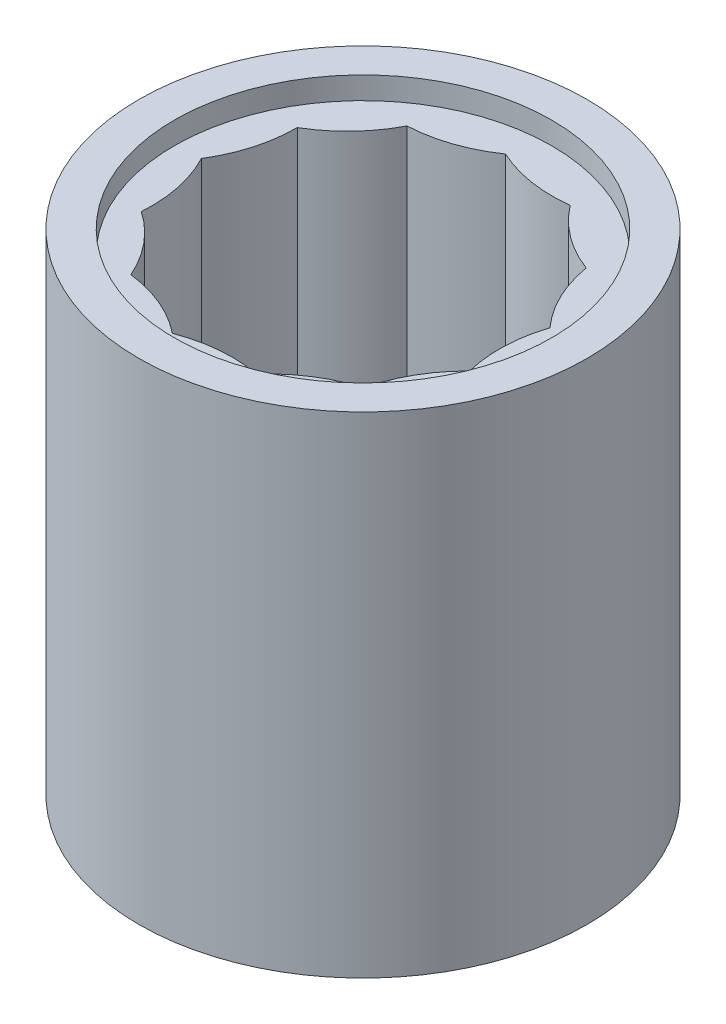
ISO-10303-21;
HEADER;
FILE_DESCRIPTION(('STEP AP214'),'2;1');
FILE_NAME('part.step','',(''),(''),'','','');
FILE_SCHEMA(('AUTOMOTIVE_DESIGN { 1 0 10303 214 1 1 1 1 }'));
ENDSEC;
DATA;
#1=APPLICATION_CONTEXT('core data for automotive mechanical design processes');
#2=APPLICATION_PROTOCOL_DEFINITION('international standard','automotive_design',2000,#1);
#3=PRODUCT_CONTEXT('',#1,'mechanical');
#4=PRODUCT('Part','Part','',(#3));
#5=PRODUCT_RELATED_PRODUCT_CATEGORY('part','',(#4));
#6=PRODUCT_DEFINITION_FORMATION('','',#4);
#7=PRODUCT_DEFINITION_CONTEXT('part definition',#1,'design');
#8=PRODUCT_DEFINITION('design','',#6,#7);
#9=PRODUCT_DEFINITION_SHAPE('','',#8);
#10=(LENGTH_UNIT() NAMED_UNIT(*) SI_UNIT(.MILLI.,.METRE.));
#11=(NAMED_UNIT(*) PLANE_ANGLE_UNIT() SI_UNIT($,.RADIAN.));
#12=(NAMED_UNIT(*) SI_UNIT($,.STERADIAN.) SOLID_ANGLE_UNIT());
#13=UNCERTAINTY_MEASURE_WITH_UNIT(LENGTH_MEASURE(1.E-05),#10,'distance_accuracy_value','');
#14=(GEOMETRIC_REPRESENTATION_CONTEXT(3) GLOBAL_UNCERTAINTY_ASSIGNED_CONTEXT((#13)) GLOBAL_UNIT_ASSIGNED_CONTEXT((#10,
#11,#12)) REPRESENTATION_CONTEXT('',''));
#15=CARTESIAN_POINT('',(0.,0.,0.));
#16=DIRECTION('',(0.,0.,1.));
#17=DIRECTION('',(1.,0.,0.));
#18=AXIS2_PLACEMENT_3D('',#15,#16,#17);
#19=CARTESIAN_POINT('',(-26.1566046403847,89.4000000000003,12.7706739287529));
#20=DIRECTION('',(0.,-1.,0.));
#21=DIRECTION('',(0.,0.,-0.999999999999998));
#22=AXIS2_PLACEMENT_3D('',#19,#20,#21);
#23=CYLINDRICAL_SURFACE('',#22,45.7150292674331);
#24=CARTESIAN_POINT('',(-26.1566046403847,89.4000000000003,12.7706739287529));
#25=DIRECTION('',(0.,-1.,0.));
#26=DIRECTION('',(0.,0.,-0.999999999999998));
#27=AXIS2_PLACEMENT_3D('',#24,#25,#26);
#28=CIRCLE('',#27,45.7150292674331);
#29=CARTESIAN_POINT('',(-26.1566046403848,89.4000000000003,-32.9443553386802));
#30=VERTEX_POINT('',#29);
#31=EDGE_CURVE('E310',#30,#30,#28,.T.);
#32=ORIENTED_EDGE('',*,*,#31,.F.);
#33=EDGE_LOOP('',(#32));
#34=FACE_BOUND('',#33,.T.);
#35=CARTESIAN_POINT('',(-26.1566046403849,84.0000000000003,12.7706739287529));
#36=DIRECTION('',(0.,-1.,0.));
#37=DIRECTION('',(0.,0.,-0.999999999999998));
#38=AXIS2_PLACEMENT_3D('',#35,#36,#37);
#39=CIRCLE('',#38,45.7150292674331);
#40=CARTESIAN_POINT('',(-26.1566046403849,84.0000000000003,-32.9443553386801));
#41=VERTEX_POINT('',#40);
#42=EDGE_CURVE('E11',#41,#41,#39,.T.);
#43=ORIENTED_EDGE('',*,*,#42,.T.);
#44=EDGE_LOOP('',(#43));
#45=FACE_BOUND('',#44,.T.);
#46=ADVANCED_FACE('F34',(#34,#45),#23,.F.);
#47=CARTESIAN_POINT('',(-26.1566046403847,89.4000000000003,12.7706739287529));
#48=DIRECTION('',(0.,-1.,0.));
#49=DIRECTION('',(0.,0.,-0.999999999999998));
#50=AXIS2_PLACEMENT_3D('',#47,#48,#49);
#51=CYLINDRICAL_SURFACE('',#50,54.3254175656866);
#52=CARTESIAN_POINT('',(-26.1566046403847,89.4000000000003,12.7706739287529));
#53=DIRECTION('',(0.,-1.,0.));
#54=DIRECTION('',(0.,0.,-0.999999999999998));
#55=AXIS2_PLACEMENT_3D('',#52,#53,#54);
#56=CIRCLE('',#55,54.3254175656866);
#57=CARTESIAN_POINT('',(-26.1566046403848,89.4000000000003,-41.5547436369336));
#58=VERTEX_POINT('',#57);
#59=EDGE_CURVE('E316',#58,#58,#56,.T.);
#60=ORIENTED_EDGE('',*,*,#59,.T.);
#61=EDGE_LOOP('',(#60));
#62=FACE_BOUND('',#61,.T.);
#63=CARTESIAN_POINT('',(-26.1566046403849,-29.3999999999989,12.7706739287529));
#64=DIRECTION('',(0.,-1.,0.));
#65=DIRECTION('',(0.,0.,-0.999999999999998));
#66=AXIS2_PLACEMENT_3D('',#63,#64,#65);
#67=CIRCLE('',#66,54.3254175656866);
#68=CARTESIAN_POINT('',(-26.1566046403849,-29.3999999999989,-41.5547436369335));
#69=VERTEX_POINT('',#68);
#70=EDGE_CURVE('E313',#69,#69,#67,.T.);
#71=ORIENTED_EDGE('',*,*,#70,.F.);
#72=EDGE_LOOP('',(#71));
#73=FACE_BOUND('',#72,.T.);
#74=ADVANCED_FACE('F285',(#62,#73),#51,.T.);
#75=CARTESIAN_POINT('',(-26.1566046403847,89.4000000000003,12.7706739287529));
#76=DIRECTION('',(0.,-1.,0.));
#77=DIRECTION('',(0.,0.,-0.999999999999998));
#78=AXIS2_PLACEMENT_3D('',#75,#76,#77);
#79=PLANE('',#78);
#80=ORIENTED_EDGE('',*,*,#31,.T.);
#81=EDGE_LOOP('',(#80));
#82=FACE_BOUND('',#81,.T.);
#83=ORIENTED_EDGE('',*,*,#59,.F.);
#84=EDGE_LOOP('',(#83));
#85=FACE_BOUND('',#84,.T.);
#86=ADVANCED_FACE('F291',(#82,#85),#79,.F.);
#87=CARTESIAN_POINT('',(-26.1566046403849,-29.3999999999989,12.7706739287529));
#88=DIRECTION('',(0.,-1.,0.));
#89=DIRECTION('',(0.,0.,-0.999999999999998));
#90=AXIS2_PLACEMENT_3D('',#87,#88,#89);
#91=PLANE('',#90);
#92=CARTESIAN_POINT('',(-26.1566046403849,-29.3999999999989,12.7706739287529));
#93=DIRECTION('',(0.,-1.,0.));
#94=DIRECTION('',(0.,0.,-0.999999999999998));
#95=AXIS2_PLACEMENT_3D('',#92,#93,#94);
#96=CIRCLE('',#95,45.7150292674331);
#97=CARTESIAN_POINT('',(-26.1566046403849,-29.3999999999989,-32.9443553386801));
#98=VERTEX_POINT('',#97);
#99=EDGE_CURVE('E309',#98,#98,#96,.T.);
#100=ORIENTED_EDGE('',*,*,#99,.F.);
#101=EDGE_LOOP('',(#100));
#102=FACE_BOUND('',#101,.T.);
#103=ORIENTED_EDGE('',*,*,#70,.T.);
#104=EDGE_LOOP('',(#103));
#105=FACE_BOUND('',#104,.T.);
#106=ADVANCED_FACE('F297',(#102,#105),#91,.T.);
#107=CARTESIAN_POINT('',(-26.1566046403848,-23.999999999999,12.7706739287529));
#108=DIRECTION('',(0.,-1.,0.));
#109=DIRECTION('',(0.,0.,-0.999999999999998));
#110=AXIS2_PLACEMENT_3D('',#107,#108,#109);
#111=CIRCLE('',#110,45.7150292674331);
#112=CARTESIAN_POINT('',(-26.1566046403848,-23.999999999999,-32.9443553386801));
#113=VERTEX_POINT('',#112);
#114=EDGE_CURVE('E38',#113,#113,#111,.T.);
#115=ORIENTED_EDGE('',*,*,#114,.F.);
#116=EDGE_LOOP('',(#115));
#117=FACE_BOUND('',#116,.T.);
#118=ORIENTED_EDGE('',*,*,#99,.T.);
#119=EDGE_LOOP('',(#118));
#120=FACE_BOUND('',#119,.T.);
#121=ADVANCED_FACE('F280',(#117,#120),#23,.F.);
#122=CARTESIAN_POINT('',(15.6258180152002,84.0000000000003,-43.3377819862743));
#123=DIRECTION('',(0.,-1.,0.));
#124=DIRECTION('',(0.,0.,-0.999999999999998));
#125=AXIS2_PLACEMENT_3D('',#122,#123,#124);
#126=PLANE('',#125);
#127=CARTESIAN_POINT('',(15.6258180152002,84.0000000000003,-43.3377819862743));
#128=DIRECTION('',(0.,1.,0.));
#129=DIRECTION('',(0.,0.,-0.999999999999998));
#130=AXIS2_PLACEMENT_3D('',#127,#128,#129);
#131=CIRCLE('',#130,34.023963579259);
#132=CARTESIAN_POINT('',(-11.4270866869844,84.0000000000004,-22.7035762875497));
#133=VERTEX_POINT('',#132);
#134=CARTESIAN_POINT('',(3.6743239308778,84.,-11.4819836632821));
#135=VERTEX_POINT('',#134);
#136=EDGE_CURVE('E43',#133,#135,#131,.T.);
#137=ORIENTED_EDGE('',*,*,#136,.T.);
#138=CARTESIAN_POINT('',(37.2176749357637,84.,-17.1805537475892));
#139=DIRECTION('',(0.,1.,0.));
#140=DIRECTION('',(0.464723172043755,0.,-0.885456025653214));
#141=AXIS2_PLACEMENT_3D('',#138,#139,#140);
#142=CIRCLE('',#141,34.023963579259);
#143=CARTESIAN_POINT('',(11.8310248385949,83.9999999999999,5.47221858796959));
#144=VERTEX_POINT('',#143);
#145=EDGE_CURVE('E136',#135,#144,#142,.T.);
#146=ORIENTED_EDGE('',*,*,#145,.T.);
#147=CARTESIAN_POINT('',(44.1804446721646,84.0000000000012,16.0147578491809));
#148=DIRECTION('',(0.,1.,0.));
#149=DIRECTION('',(0.822983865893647,0.,-0.568064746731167));
#150=AXIS2_PLACEMENT_3D('',#147,#148,#149);
#151=CIRCLE('',#150,34.023963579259);
#152=CARTESIAN_POINT('',(11.1744141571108,84.,24.2750270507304));
#153=VERTEX_POINT('',#152);
#154=EDGE_CURVE('E147',#144,#153,#151,.T.);
#155=ORIENTED_EDGE('',*,*,#154,.T.);
#156=CARTESIAN_POINT('',(34.9190405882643,84.0000000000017,48.6435069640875));
#157=DIRECTION('',(0.,1.,0.));
#158=DIRECTION('',(0.99270887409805,0.,-0.120536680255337));
#159=AXIS2_PLACEMENT_3D('',#156,#157,#158);
#160=CIRCLE('',#159,34.023963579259);
#161=CARTESIAN_POINT('',(1.85491348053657,84.,40.6189449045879));
#162=VERTEX_POINT('',#161);
#163=EDGE_CURVE('E158',#153,#162,#160,.T.);
#164=ORIENTED_EDGE('',*,*,#163,.T.);
#165=CARTESIAN_POINT('',(11.5551387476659,84.0000000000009,73.2308403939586));
#166=DIRECTION('',(0.,1.,0.));
#167=DIRECTION('',(0.935016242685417,0.,0.354604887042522));
#168=AXIS2_PLACEMENT_3D('',#165,#166,#167);
#169=CIRCLE('',#168,34.023963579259);
#170=CARTESIAN_POINT('',(-13.9924918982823,84.,50.7597775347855));
#171=VERTEX_POINT('',#170);
#172=EDGE_CURVE('E166',#162,#171,#169,.T.);
#173=ORIENTED_EDGE('',*,*,#172,.T.);
#174=CARTESIAN_POINT('',(-20.5588725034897,84.0000000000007,84.1440963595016));
#175=DIRECTION('',(0.,1.,0.));
#176=DIRECTION('',(0.663122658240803,0.,0.748510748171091));
#177=AXIS2_PLACEMENT_3D('',#174,#175,#176);
#178=CIRCLE('',#177,34.023963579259);
#179=CARTESIAN_POINT('',(-32.7373523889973,84.,52.3743823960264));
#180=VERTEX_POINT('',#179);
#181=EDGE_CURVE('E175',#171,#180,#178,.T.);
#182=ORIENTED_EDGE('',*,*,#181,.T.);
#183=CARTESIAN_POINT('',(-54.0660602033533,84.,78.8831794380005));
#184=DIRECTION('',(0.,1.,0.));
#185=DIRECTION('',(0.239315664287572,0.,0.970941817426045));
#186=AXIS2_PLACEMENT_3D('',#183,#184,#185);
#187=CIRCLE('',#186,34.023963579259);
#188=CARTESIAN_POINT('',(-50.0854463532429,84.,45.0928729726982));
#189=VERTEX_POINT('',#188);
#190=EDGE_CURVE('E184',#180,#189,#187,.T.);
#191=ORIENTED_EDGE('',*,*,#190,.T.);
#192=CARTESIAN_POINT('',(-81.2903314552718,84.,58.6533022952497));
#193=DIRECTION('',(0.,1.,0.));
#194=DIRECTION('',(-0.239315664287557,0.,0.970941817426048));
#195=AXIS2_PLACEMENT_3D('',#192,#193,#194);
#196=CIRCLE('',#195,34.023963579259);
#197=CARTESIAN_POINT('',(-62.0625345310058,83.9999999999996,30.5833553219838));
#198=VERTEX_POINT('',#197);
#199=EDGE_CURVE('E193',#189,#198,#196,.T.);
#200=ORIENTED_EDGE('',*,*,#199,.T.);
#201=CARTESIAN_POINT('',(-95.9949338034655,84.,28.0888859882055));
#202=DIRECTION('',(0.,1.,0.));
#203=DIRECTION('',(-0.663122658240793,0.,0.748510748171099));
#204=AXIS2_PLACEMENT_3D('',#201,#202,#203);
#205=CIRCLE('',#204,34.023963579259);
#206=CARTESIAN_POINT('',(-65.9248103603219,84.,12.1697850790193));
#207=VERTEX_POINT('',#206);
#208=EDGE_CURVE('E202',#198,#207,#205,.T.);
#209=ORIENTED_EDGE('',*,*,#208,.T.);
#210=CARTESIAN_POINT('',(-94.811220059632,84.,-5.80813004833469));
#211=DIRECTION('',(0.,1.,0.));
#212=DIRECTION('',(-0.935016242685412,0.,0.354604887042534));
#213=AXIS2_PLACEMENT_3D('',#210,#211,#212);
#214=CIRCLE('',#213,34.023963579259);
#215=CARTESIAN_POINT('',(-60.7874729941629,84.0000000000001,-5.92951072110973));
#216=VERTEX_POINT('',#215);
#217=EDGE_CURVE('E211',#207,#216,#214,.T.);
#218=ORIENTED_EDGE('',*,*,#217,.T.);
#219=CARTESIAN_POINT('',(-78.0103647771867,84.,-35.2723479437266));
#220=DIRECTION('',(0.,1.,0.));
#221=DIRECTION('',(-0.992708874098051,0.,-0.120536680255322));
#222=AXIS2_PLACEMENT_3D('',#219,#220,#221);
#223=CIRCLE('',#222,34.023963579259);
#224=CARTESIAN_POINT('',(-47.8274245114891,84.0000000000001,-19.5682015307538));
#225=VERTEX_POINT('',#224);
#226=EDGE_CURVE('E220',#216,#225,#223,.T.);
#227=ORIENTED_EDGE('',*,*,#226,.T.);
#228=CARTESIAN_POINT('',(-49.4412414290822,84.0000000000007,-53.5538704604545));
#229=DIRECTION('',(0.,1.,0.));
#230=DIRECTION('',(-0.822983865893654,0.,-0.568064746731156));
#231=AXIS2_PLACEMENT_3D('',#228,#229,#230);
#232=CIRCLE('',#231,34.023963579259);
#233=CARTESIAN_POINT('',(-30.0136558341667,84.,-25.6218276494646));
#234=VERTEX_POINT('',#233);
#235=EDGE_CURVE('E229',#225,#234,#232,.T.);
#236=ORIENTED_EDGE('',*,*,#235,.T.);
#237=CARTESIAN_POINT('',(-15.6486918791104,84.0000000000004,-56.464621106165));
#238=DIRECTION('',(0.,1.,0.));
#239=DIRECTION('',(-0.464723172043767,0.,-0.885456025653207));
#240=AXIS2_PLACEMENT_3D('',#237,#238,#239);
#241=CIRCLE('',#240,34.023963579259);
#242=EDGE_CURVE('E238',#234,#133,#241,.T.);
#243=ORIENTED_EDGE('',*,*,#242,.T.);
#244=EDGE_LOOP('',(#137,#146,#155,#164,#173,#182,#191,#200,#209,#218,#227,#236,#243));
#245=FACE_BOUND('',#244,.T.);
#246=ORIENTED_EDGE('',*,*,#42,.F.);
#247=EDGE_LOOP('',(#246));
#248=FACE_BOUND('',#247,.T.);
#249=ADVANCED_FACE('F277',(#245,#248),#126,.F.);
#250=CARTESIAN_POINT('',(15.6258180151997,-23.9999999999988,-43.3377819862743));
#251=DIRECTION('',(0.,-1.,0.));
#252=DIRECTION('',(0.,0.,-0.999999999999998));
#253=AXIS2_PLACEMENT_3D('',#250,#251,#252);
#254=PLANE('',#253);
#255=CARTESIAN_POINT('',(37.2176749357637,-24.,-17.1805537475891));
#256=DIRECTION('',(0.,1.,0.));
#257=DIRECTION('',(0.464723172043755,0.,-0.885456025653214));
#258=AXIS2_PLACEMENT_3D('',#255,#256,#257);
#259=CIRCLE('',#258,34.023963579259);
#260=CARTESIAN_POINT('',(3.67432393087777,-24.,-11.481983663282));
#261=VERTEX_POINT('',#260);
#262=CARTESIAN_POINT('',(11.8310248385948,-24.,5.47221858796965));
#263=VERTEX_POINT('',#262);
#264=EDGE_CURVE('E129',#261,#263,#259,.T.);
#265=ORIENTED_EDGE('',*,*,#264,.F.);
#266=CARTESIAN_POINT('',(15.6258180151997,-23.9999999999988,-43.3377819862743));
#267=DIRECTION('',(0.,1.,0.));
#268=DIRECTION('',(0.,0.,-0.999999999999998));
#269=AXIS2_PLACEMENT_3D('',#266,#267,#268);
#270=CIRCLE('',#269,34.023963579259);
#271=CARTESIAN_POINT('',(-11.4270866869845,-24.,-22.7035762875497));
#272=VERTEX_POINT('',#271);
#273=EDGE_CURVE('E246',#272,#261,#270,.T.);
#274=ORIENTED_EDGE('',*,*,#273,.F.);
#275=CARTESIAN_POINT('',(-15.6486918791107,-24.,-56.464621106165));
#276=DIRECTION('',(0.,1.,0.));
#277=DIRECTION('',(-0.464723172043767,0.,-0.885456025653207));
#278=AXIS2_PLACEMENT_3D('',#275,#276,#277);
#279=CIRCLE('',#278,34.023963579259);
#280=CARTESIAN_POINT('',(-30.0136558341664,-23.9999999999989,-25.6218276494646));
#281=VERTEX_POINT('',#280);
#282=EDGE_CURVE('E237',#281,#272,#279,.T.);
#283=ORIENTED_EDGE('',*,*,#282,.F.);
#284=CARTESIAN_POINT('',(-49.4412414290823,-23.999999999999,-53.5538704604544));
#285=DIRECTION('',(0.,1.,0.));
#286=DIRECTION('',(-0.822983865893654,0.,-0.568064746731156));
#287=AXIS2_PLACEMENT_3D('',#284,#285,#286);
#288=CIRCLE('',#287,34.023963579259);
#289=CARTESIAN_POINT('',(-47.8274245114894,-24.,-19.5682015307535));
#290=VERTEX_POINT('',#289);
#291=EDGE_CURVE('E228',#290,#281,#288,.T.);
#292=ORIENTED_EDGE('',*,*,#291,.F.);
#293=CARTESIAN_POINT('',(-78.0103647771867,-24.,-35.2723479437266));
#294=DIRECTION('',(0.,1.,0.));
#295=DIRECTION('',(-0.992708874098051,0.,-0.120536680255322));
#296=AXIS2_PLACEMENT_3D('',#293,#294,#295);
#297=CIRCLE('',#296,34.023963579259);
#298=CARTESIAN_POINT('',(-60.7874729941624,-23.9999999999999,-5.92951072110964));
#299=VERTEX_POINT('',#298);
#300=EDGE_CURVE('E219',#299,#290,#297,.T.);
#301=ORIENTED_EDGE('',*,*,#300,.F.);
#302=CARTESIAN_POINT('',(-94.8112200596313,-23.9999999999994,-5.80813004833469));
#303=DIRECTION('',(0.,1.,0.));
#304=DIRECTION('',(-0.935016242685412,0.,0.354604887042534));
#305=AXIS2_PLACEMENT_3D('',#302,#303,#304);
#306=CIRCLE('',#305,34.023963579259);
#307=CARTESIAN_POINT('',(-65.9248103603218,-24.,12.1697850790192));
#308=VERTEX_POINT('',#307);
#309=EDGE_CURVE('E210',#308,#299,#306,.T.);
#310=ORIENTED_EDGE('',*,*,#309,.F.);
#311=CARTESIAN_POINT('',(-95.9949338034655,-24.,28.0888859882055));
#312=DIRECTION('',(0.,1.,0.));
#313=DIRECTION('',(-0.663122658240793,0.,0.748510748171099));
#314=AXIS2_PLACEMENT_3D('',#311,#312,#313);
#315=CIRCLE('',#314,34.023963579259);
#316=CARTESIAN_POINT('',(-62.0625345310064,-24.,30.5833553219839));
#317=VERTEX_POINT('',#316);
#318=EDGE_CURVE('E201',#317,#308,#315,.T.);
#319=ORIENTED_EDGE('',*,*,#318,.F.);
#320=CARTESIAN_POINT('',(-81.2903314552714,-23.9999999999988,58.6533022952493));
#321=DIRECTION('',(0.,1.,0.));
#322=DIRECTION('',(-0.239315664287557,0.,0.970941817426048));
#323=AXIS2_PLACEMENT_3D('',#320,#321,#322);
#324=CIRCLE('',#323,34.023963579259);
#325=CARTESIAN_POINT('',(-50.0854463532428,-24.0000000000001,45.0928729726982));
#326=VERTEX_POINT('',#325);
#327=EDGE_CURVE('E192',#326,#317,#324,.T.);
#328=ORIENTED_EDGE('',*,*,#327,.F.);
#329=CARTESIAN_POINT('',(-54.0660602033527,-23.9999999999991,78.8831794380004));
#330=DIRECTION('',(0.,1.,0.));
#331=DIRECTION('',(0.239315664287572,0.,0.970941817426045));
#332=AXIS2_PLACEMENT_3D('',#329,#330,#331);
#333=CIRCLE('',#332,34.023963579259);
#334=CARTESIAN_POINT('',(-32.7373523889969,-23.9999999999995,52.3743823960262));
#335=VERTEX_POINT('',#334);
#336=EDGE_CURVE('E183',#335,#326,#333,.T.);
#337=ORIENTED_EDGE('',*,*,#336,.F.);
#338=CARTESIAN_POINT('',(-20.55887250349,-23.9999999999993,84.1440963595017));
#339=DIRECTION('',(0.,1.,0.));
#340=DIRECTION('',(0.663122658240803,0.,0.748510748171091));
#341=AXIS2_PLACEMENT_3D('',#338,#339,#340);
#342=CIRCLE('',#341,34.023963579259);
#343=CARTESIAN_POINT('',(-13.9924918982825,-24.,50.7597775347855));
#344=VERTEX_POINT('',#343);
#345=EDGE_CURVE('E174',#344,#335,#342,.T.);
#346=ORIENTED_EDGE('',*,*,#345,.F.);
#347=CARTESIAN_POINT('',(11.5551387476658,-23.9999999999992,73.230840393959));
#348=DIRECTION('',(0.,1.,0.));
#349=DIRECTION('',(0.935016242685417,0.,0.354604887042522));
#350=AXIS2_PLACEMENT_3D('',#347,#348,#349);
#351=CIRCLE('',#350,34.023963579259);
#352=CARTESIAN_POINT('',(1.85491348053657,-24.,40.6189449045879));
#353=VERTEX_POINT('',#352);
#354=EDGE_CURVE('E165',#353,#344,#351,.T.);
#355=ORIENTED_EDGE('',*,*,#354,.F.);
#356=CARTESIAN_POINT('',(34.9190405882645,-24.,48.6435069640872));
#357=DIRECTION('',(0.,1.,0.));
#358=DIRECTION('',(0.99270887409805,0.,-0.120536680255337));
#359=AXIS2_PLACEMENT_3D('',#356,#357,#358);
#360=CIRCLE('',#359,34.023963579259);
#361=CARTESIAN_POINT('',(11.1744141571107,-23.9999999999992,24.2750270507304));
#362=VERTEX_POINT('',#361);
#363=EDGE_CURVE('E143',#362,#353,#360,.T.);
#364=ORIENTED_EDGE('',*,*,#363,.F.);
#365=CARTESIAN_POINT('',(44.1804446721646,-23.9999999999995,16.0147578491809));
#366=DIRECTION('',(0.,1.,0.));
#367=DIRECTION('',(0.822983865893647,0.,-0.568064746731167));
#368=AXIS2_PLACEMENT_3D('',#365,#366,#367);
#369=CIRCLE('',#368,34.023963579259);
#370=EDGE_CURVE('E139',#263,#362,#369,.T.);
#371=ORIENTED_EDGE('',*,*,#370,.F.);
#372=EDGE_LOOP('',(#265,#274,#283,#292,#301,#310,#319,#328,#337,#346,#355,#364,#371));
#373=FACE_BOUND('',#372,.T.);
#374=ORIENTED_EDGE('',*,*,#114,.T.);
#375=EDGE_LOOP('',(#374));
#376=FACE_BOUND('',#375,.T.);
#377=ADVANCED_FACE('F140',(#373,#376),#254,.T.);
#378=CARTESIAN_POINT('',(15.6258180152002,84.0000000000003,-43.3377819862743));
#379=DIRECTION('',(0.,-1.,0.));
#380=DIRECTION('',(0.,0.,-0.999999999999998));
#381=AXIS2_PLACEMENT_3D('',#378,#379,#380);
#382=CYLINDRICAL_SURFACE('',#381,34.023963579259);
#383=DIRECTION('',(0.,-1.,0.));
#384=VECTOR('',#383,1.);
#385=CARTESIAN_POINT('',(-11.4270866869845,30.,-22.7035762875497));
#386=LINE('',#385,#384);
#387=EDGE_CURVE('E244',#272,#133,#386,.F.);
#388=ORIENTED_EDGE('',*,*,#387,.F.);
#389=ORIENTED_EDGE('',*,*,#273,.T.);
#390=DIRECTION('',(0.,-1.,0.));
#391=VECTOR('',#390,1.);
#392=CARTESIAN_POINT('',(3.67432393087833,29.9999999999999,-11.481983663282));
#393=LINE('',#392,#391);
#394=EDGE_CURVE('E51',#135,#261,#393,.T.);
#395=ORIENTED_EDGE('',*,*,#394,.F.);
#396=ORIENTED_EDGE('',*,*,#136,.F.);
#397=EDGE_LOOP('',(#388,#389,#395,#396));
#398=FACE_BOUND('',#397,.T.);
#399=ADVANCED_FACE('F36',(#398),#382,.T.);
#400=CARTESIAN_POINT('',(-15.6486918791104,84.0000000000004,-56.464621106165));
#401=DIRECTION('',(0.,-1.,0.));
#402=DIRECTION('',(0.,0.,-0.999999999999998));
#403=AXIS2_PLACEMENT_3D('',#400,#401,#402);
#404=CYLINDRICAL_SURFACE('',#403,34.023963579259);
#405=ORIENTED_EDGE('',*,*,#282,.T.);
#406=ORIENTED_EDGE('',*,*,#387,.T.);
#407=ORIENTED_EDGE('',*,*,#242,.F.);
#408=DIRECTION('',(0.,-1.,0.));
#409=VECTOR('',#408,1.);
#410=CARTESIAN_POINT('',(-30.0136558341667,30.0000000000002,-25.6218276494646));
#411=LINE('',#410,#409);
#412=EDGE_CURVE('E232',#281,#234,#411,.F.);
#413=ORIENTED_EDGE('',*,*,#412,.F.);
#414=EDGE_LOOP('',(#405,#406,#407,#413));
#415=FACE_BOUND('',#414,.T.);
#416=ADVANCED_FACE('F250',(#415),#404,.T.);
#417=CARTESIAN_POINT('',(37.2176749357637,84.,-17.1805537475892));
#418=DIRECTION('',(0.,-1.,0.));
#419=DIRECTION('',(0.,0.,-0.999999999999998));
#420=AXIS2_PLACEMENT_3D('',#417,#418,#419);
#421=CYLINDRICAL_SURFACE('',#420,34.023963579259);
#422=ORIENTED_EDGE('',*,*,#145,.F.);
#423=ORIENTED_EDGE('',*,*,#394,.T.);
#424=ORIENTED_EDGE('',*,*,#264,.T.);
#425=DIRECTION('',(0.,-1.,0.));
#426=VECTOR('',#425,1.);
#427=CARTESIAN_POINT('',(11.8310248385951,30.0000000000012,5.47221858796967));
#428=LINE('',#427,#426);
#429=EDGE_CURVE('E134',#263,#144,#428,.F.);
#430=ORIENTED_EDGE('',*,*,#429,.T.);
#431=EDGE_LOOP('',(#422,#423,#424,#430));
#432=FACE_BOUND('',#431,.T.);
#433=ADVANCED_FACE('F132',(#432),#421,.T.);
#434=CARTESIAN_POINT('',(-49.4412414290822,84.0000000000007,-53.5538704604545));
#435=DIRECTION('',(0.,-1.,0.));
#436=DIRECTION('',(0.,0.,-0.999999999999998));
#437=AXIS2_PLACEMENT_3D('',#434,#435,#436);
#438=CYLINDRICAL_SURFACE('',#437,34.023963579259);
#439=ORIENTED_EDGE('',*,*,#291,.T.);
#440=ORIENTED_EDGE('',*,*,#412,.T.);
#441=ORIENTED_EDGE('',*,*,#235,.F.);
#442=DIRECTION('',(0.,-1.,0.));
#443=VECTOR('',#442,1.);
#444=CARTESIAN_POINT('',(-47.8274245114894,30.0000000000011,-19.5682015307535));
#445=LINE('',#444,#443);
#446=EDGE_CURVE('E223',#290,#225,#445,.F.);
#447=ORIENTED_EDGE('',*,*,#446,.F.);
#448=EDGE_LOOP('',(#439,#440,#441,#447));
#449=FACE_BOUND('',#448,.T.);
#450=ADVANCED_FACE('F252',(#449),#438,.T.);
#451=CARTESIAN_POINT('',(-78.0103647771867,84.,-35.2723479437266));
#452=DIRECTION('',(0.,-1.,0.));
#453=DIRECTION('',(0.,0.,-0.999999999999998));
#454=AXIS2_PLACEMENT_3D('',#451,#452,#453);
#455=CYLINDRICAL_SURFACE('',#454,34.023963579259);
#456=ORIENTED_EDGE('',*,*,#300,.T.);
#457=ORIENTED_EDGE('',*,*,#446,.T.);
#458=ORIENTED_EDGE('',*,*,#226,.F.);
#459=DIRECTION('',(0.,-1.,0.));
#460=VECTOR('',#459,1.);
#461=CARTESIAN_POINT('',(-60.7874729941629,30.,-5.9295107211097));
#462=LINE('',#461,#460);
#463=EDGE_CURVE('E214',#299,#216,#462,.F.);
#464=ORIENTED_EDGE('',*,*,#463,.F.);
#465=EDGE_LOOP('',(#456,#457,#458,#464));
#466=FACE_BOUND('',#465,.T.);
#467=ADVANCED_FACE('F255',(#466),#455,.T.);
#468=CARTESIAN_POINT('',(-94.811220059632,84.,-5.80813004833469));
#469=DIRECTION('',(0.,-1.,0.));
#470=DIRECTION('',(0.,0.,-0.999999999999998));
#471=AXIS2_PLACEMENT_3D('',#468,#469,#470);
#472=CYLINDRICAL_SURFACE('',#471,34.023963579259);
#473=ORIENTED_EDGE('',*,*,#309,.T.);
#474=ORIENTED_EDGE('',*,*,#463,.T.);
#475=ORIENTED_EDGE('',*,*,#217,.F.);
#476=DIRECTION('',(0.,-1.,0.));
#477=VECTOR('',#476,1.);
#478=CARTESIAN_POINT('',(-65.9248103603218,30.0000000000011,12.1697850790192));
#479=LINE('',#478,#477);
#480=EDGE_CURVE('E205',#308,#207,#479,.F.);
#481=ORIENTED_EDGE('',*,*,#480,.F.);
#482=EDGE_LOOP('',(#473,#474,#475,#481));
#483=FACE_BOUND('',#482,.T.);
#484=ADVANCED_FACE('F259',(#483),#472,.T.);
#485=CARTESIAN_POINT('',(-95.9949338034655,84.,28.0888859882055));
#486=DIRECTION('',(0.,-1.,0.));
#487=DIRECTION('',(0.,0.,-0.999999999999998));
#488=AXIS2_PLACEMENT_3D('',#485,#486,#487);
#489=CYLINDRICAL_SURFACE('',#488,34.023963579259);
#490=ORIENTED_EDGE('',*,*,#318,.T.);
#491=ORIENTED_EDGE('',*,*,#480,.T.);
#492=ORIENTED_EDGE('',*,*,#208,.F.);
#493=DIRECTION('',(0.,-1.,0.));
#494=VECTOR('',#493,1.);
#495=CARTESIAN_POINT('',(-62.0625345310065,30.0000000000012,30.583355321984));
#496=LINE('',#495,#494);
#497=EDGE_CURVE('E196',#317,#198,#496,.F.);
#498=ORIENTED_EDGE('',*,*,#497,.F.);
#499=EDGE_LOOP('',(#490,#491,#492,#498));
#500=FACE_BOUND('',#499,.T.);
#501=ADVANCED_FACE('F261',(#500),#489,.T.);
#502=CARTESIAN_POINT('',(-81.2903314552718,84.,58.6533022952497));
#503=DIRECTION('',(0.,-1.,0.));
#504=DIRECTION('',(0.,0.,-0.999999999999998));
#505=AXIS2_PLACEMENT_3D('',#502,#503,#504);
#506=CYLINDRICAL_SURFACE('',#505,34.023963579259);
#507=ORIENTED_EDGE('',*,*,#327,.T.);
#508=ORIENTED_EDGE('',*,*,#497,.T.);
#509=ORIENTED_EDGE('',*,*,#199,.F.);
#510=DIRECTION('',(0.,-1.,0.));
#511=VECTOR('',#510,1.);
#512=CARTESIAN_POINT('',(-50.0854463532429,30.0000000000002,45.0928729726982));
#513=LINE('',#512,#511);
#514=EDGE_CURVE('E187',#326,#189,#513,.F.);
#515=ORIENTED_EDGE('',*,*,#514,.F.);
#516=EDGE_LOOP('',(#507,#508,#509,#515));
#517=FACE_BOUND('',#516,.T.);
#518=ADVANCED_FACE('F264',(#517),#506,.T.);
#519=CARTESIAN_POINT('',(-54.0660602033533,84.,78.8831794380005));
#520=DIRECTION('',(0.,-1.,0.));
#521=DIRECTION('',(0.,0.,-0.999999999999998));
#522=AXIS2_PLACEMENT_3D('',#519,#520,#521);
#523=CYLINDRICAL_SURFACE('',#522,34.023963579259);
#524=ORIENTED_EDGE('',*,*,#336,.T.);
#525=ORIENTED_EDGE('',*,*,#514,.T.);
#526=ORIENTED_EDGE('',*,*,#190,.F.);
#527=DIRECTION('',(0.,-1.,0.));
#528=VECTOR('',#527,1.);
#529=CARTESIAN_POINT('',(-32.7373523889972,30.,52.3743823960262));
#530=LINE('',#529,#528);
#531=EDGE_CURVE('E178',#335,#180,#530,.F.);
#532=ORIENTED_EDGE('',*,*,#531,.F.);
#533=EDGE_LOOP('',(#524,#525,#526,#532));
#534=FACE_BOUND('',#533,.T.);
#535=ADVANCED_FACE('F268',(#534),#523,.T.);
#536=CARTESIAN_POINT('',(-20.5588725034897,84.0000000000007,84.1440963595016));
#537=DIRECTION('',(0.,-1.,0.));
#538=DIRECTION('',(0.,0.,-0.999999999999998));
#539=AXIS2_PLACEMENT_3D('',#536,#537,#538);
#540=CYLINDRICAL_SURFACE('',#539,34.023963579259);
#541=ORIENTED_EDGE('',*,*,#345,.T.);
#542=ORIENTED_EDGE('',*,*,#531,.T.);
#543=ORIENTED_EDGE('',*,*,#181,.F.);
#544=DIRECTION('',(0.,-1.,0.));
#545=VECTOR('',#544,1.);
#546=CARTESIAN_POINT('',(-13.9924918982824,30.0000000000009,50.759777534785));
#547=LINE('',#546,#545);
#548=EDGE_CURVE('E169',#344,#171,#547,.F.);
#549=ORIENTED_EDGE('',*,*,#548,.F.);
#550=EDGE_LOOP('',(#541,#542,#543,#549));
#551=FACE_BOUND('',#550,.T.);
#552=ADVANCED_FACE('F270',(#551),#540,.T.);
#553=CARTESIAN_POINT('',(11.5551387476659,84.0000000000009,73.2308403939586));
#554=DIRECTION('',(0.,-1.,0.));
#555=DIRECTION('',(0.,0.,-0.999999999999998));
#556=AXIS2_PLACEMENT_3D('',#553,#554,#555);
#557=CYLINDRICAL_SURFACE('',#556,34.023963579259);
#558=ORIENTED_EDGE('',*,*,#354,.T.);
#559=ORIENTED_EDGE('',*,*,#548,.T.);
#560=ORIENTED_EDGE('',*,*,#172,.F.);
#561=DIRECTION('',(0.,-1.,0.));
#562=VECTOR('',#561,1.);
#563=CARTESIAN_POINT('',(1.85491348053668,30.,40.6189449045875));
#564=LINE('',#563,#562);
#565=EDGE_CURVE('E161',#353,#162,#564,.F.);
#566=ORIENTED_EDGE('',*,*,#565,.F.);
#567=EDGE_LOOP('',(#558,#559,#560,#566));
#568=FACE_BOUND('',#567,.T.);
#569=ADVANCED_FACE('F273',(#568),#557,.T.);
#570=CARTESIAN_POINT('',(34.9190405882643,84.0000000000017,48.6435069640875));
#571=DIRECTION('',(0.,-1.,0.));
#572=DIRECTION('',(0.,0.,-0.999999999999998));
#573=AXIS2_PLACEMENT_3D('',#570,#571,#572);
#574=CYLINDRICAL_SURFACE('',#573,34.023963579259);
#575=ORIENTED_EDGE('',*,*,#363,.T.);
#576=ORIENTED_EDGE('',*,*,#565,.T.);
#577=ORIENTED_EDGE('',*,*,#163,.F.);
#578=DIRECTION('',(0.,-1.,0.));
#579=VECTOR('',#578,1.);
#580=CARTESIAN_POINT('',(11.1744141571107,30.,24.2750270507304));
#581=LINE('',#580,#579);
#582=EDGE_CURVE('E155',#362,#153,#581,.F.);
#583=ORIENTED_EDGE('',*,*,#582,.F.);
#584=EDGE_LOOP('',(#575,#576,#577,#583));
#585=FACE_BOUND('',#584,.T.);
#586=ADVANCED_FACE('F275',(#585),#574,.T.);
#587=CARTESIAN_POINT('',(44.1804446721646,84.0000000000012,16.0147578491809));
#588=DIRECTION('',(0.,-1.,0.));
#589=DIRECTION('',(0.,0.,-0.999999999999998));
#590=AXIS2_PLACEMENT_3D('',#587,#588,#589);
#591=CYLINDRICAL_SURFACE('',#590,34.023963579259);
#592=ORIENTED_EDGE('',*,*,#370,.T.);
#593=ORIENTED_EDGE('',*,*,#582,.T.);
#594=ORIENTED_EDGE('',*,*,#154,.F.);
#595=ORIENTED_EDGE('',*,*,#429,.F.);
#596=EDGE_LOOP('',(#592,#593,#594,#595));
#597=FACE_BOUND('',#596,.T.);
#598=ADVANCED_FACE('F150',(#597),#591,.T.);
#599=CLOSED_SHELL('',(#46,#74,#86,#106,#121,#249,#377,#399,#416,#433,#450,#467,#484,#501,#518,
#535,#552,#569,#586,#598));
#600=MANIFOLD_SOLID_BREP('B2',#599);
#601=ADVANCED_BREP_SHAPE_REPRESENTATION('',(#18,#600),#14);
#602=SHAPE_DEFINITION_REPRESENTATION(#9,#601);
ENDSEC;
END-ISO-10303-21;
